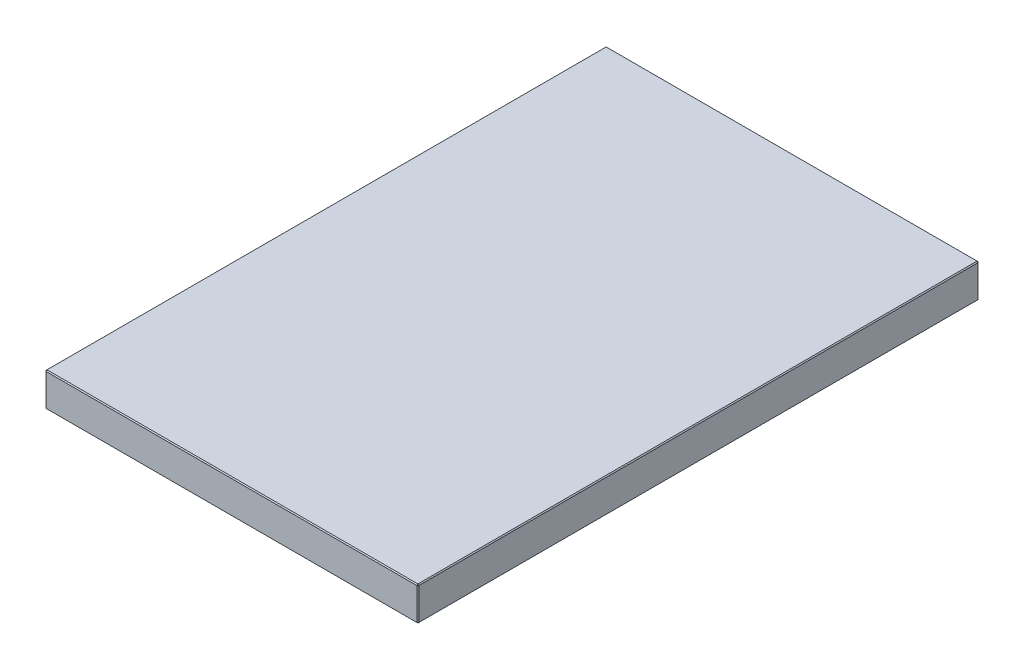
ISO-10303-21;
HEADER;
FILE_DESCRIPTION(('STEP AP214'),'2;1');
FILE_NAME('part.step','',(''),(''),'','','');
FILE_SCHEMA(('AUTOMOTIVE_DESIGN { 1 0 10303 214 1 1 1 1 }'));
ENDSEC;
DATA;
#1=APPLICATION_CONTEXT('core data for automotive mechanical design processes');
#2=APPLICATION_PROTOCOL_DEFINITION('international standard','automotive_design',2000,#1);
#3=PRODUCT_CONTEXT('',#1,'mechanical');
#4=PRODUCT('Part','Part','',(#3));
#5=PRODUCT_RELATED_PRODUCT_CATEGORY('part','',(#4));
#6=PRODUCT_DEFINITION_FORMATION('','',#4);
#7=PRODUCT_DEFINITION_CONTEXT('part definition',#1,'design');
#8=PRODUCT_DEFINITION('design','',#6,#7);
#9=PRODUCT_DEFINITION_SHAPE('','',#8);
#10=(LENGTH_UNIT() NAMED_UNIT(*) SI_UNIT(.MILLI.,.METRE.));
#11=(NAMED_UNIT(*) PLANE_ANGLE_UNIT() SI_UNIT($,.RADIAN.));
#12=(NAMED_UNIT(*) SI_UNIT($,.STERADIAN.) SOLID_ANGLE_UNIT());
#13=UNCERTAINTY_MEASURE_WITH_UNIT(LENGTH_MEASURE(1.E-05),#10,'distance_accuracy_value','');
#14=(GEOMETRIC_REPRESENTATION_CONTEXT(3) GLOBAL_UNCERTAINTY_ASSIGNED_CONTEXT((#13)) GLOBAL_UNIT_ASSIGNED_CONTEXT((#10,
#11,#12)) REPRESENTATION_CONTEXT('',''));
#15=CARTESIAN_POINT('',(0.,0.,0.));
#16=DIRECTION('',(0.,0.,1.));
#17=DIRECTION('',(1.,0.,0.));
#18=AXIS2_PLACEMENT_3D('',#15,#16,#17);
#19=CARTESIAN_POINT('',(198.,36.,298.));
#20=DIRECTION('',(-1.,0.,0.));
#21=DIRECTION('',(0.,0.,1.));
#22=AXIS2_PLACEMENT_3D('',#19,#20,#21);
#23=PLANE('',#22);
#24=DIRECTION('',(0.,0.,-1.));
#25=VECTOR('',#24,1.);
#26=CARTESIAN_POINT('',(198.,1.,-298.));
#27=LINE('',#26,#25);
#28=CARTESIAN_POINT('',(198.,1.,297.));
#29=VERTEX_POINT('',#28);
#30=CARTESIAN_POINT('',(198.,1.,-297.));
#31=VERTEX_POINT('',#30);
#32=EDGE_CURVE('E151',#29,#31,#27,.T.);
#33=ORIENTED_EDGE('',*,*,#32,.T.);
#34=DIRECTION('',(0.,1.,0.));
#35=VECTOR('',#34,1.);
#36=CARTESIAN_POINT('',(198.,36.,-297.));
#37=LINE('',#36,#35);
#38=CARTESIAN_POINT('',(198.,35.,-297.));
#39=VERTEX_POINT('',#38);
#40=EDGE_CURVE('E153',#31,#39,#37,.T.);
#41=ORIENTED_EDGE('',*,*,#40,.T.);
#42=DIRECTION('',(0.,0.,1.));
#43=VECTOR('',#42,1.);
#44=CARTESIAN_POINT('',(198.,35.,298.));
#45=LINE('',#44,#43);
#46=CARTESIAN_POINT('',(198.,35.,297.));
#47=VERTEX_POINT('',#46);
#48=EDGE_CURVE('E147',#39,#47,#45,.T.);
#49=ORIENTED_EDGE('',*,*,#48,.T.);
#50=DIRECTION('',(0.,-1.,0.));
#51=VECTOR('',#50,1.);
#52=CARTESIAN_POINT('',(198.,36.,297.));
#53=LINE('',#52,#51);
#54=EDGE_CURVE('E149',#47,#29,#53,.T.);
#55=ORIENTED_EDGE('',*,*,#54,.T.);
#56=EDGE_LOOP('',(#33,#41,#49,#55));
#57=FACE_BOUND('',#56,.T.);
#58=ADVANCED_FACE('F16',(#57),#23,.F.);
#59=CARTESIAN_POINT('',(-198.,36.,-298.));
#60=DIRECTION('',(0.,0.,1.));
#61=DIRECTION('',(1.,0.,0.));
#62=AXIS2_PLACEMENT_3D('',#59,#60,#61);
#63=PLANE('',#62);
#64=DIRECTION('',(0.,-1.,0.));
#65=VECTOR('',#64,1.);
#66=CARTESIAN_POINT('',(197.,36.,-298.));
#67=LINE('',#66,#65);
#68=CARTESIAN_POINT('',(197.,35.,-298.));
#69=VERTEX_POINT('',#68);
#70=CARTESIAN_POINT('',(197.,1.,-298.));
#71=VERTEX_POINT('',#70);
#72=EDGE_CURVE('E115',#69,#71,#67,.T.);
#73=ORIENTED_EDGE('',*,*,#72,.T.);
#74=DIRECTION('',(-1.,0.,0.));
#75=VECTOR('',#74,1.);
#76=CARTESIAN_POINT('',(-198.,1.,-298.));
#77=LINE('',#76,#75);
#78=CARTESIAN_POINT('',(-197.,1.,-298.));
#79=VERTEX_POINT('',#78);
#80=EDGE_CURVE('E111',#71,#79,#77,.T.);
#81=ORIENTED_EDGE('',*,*,#80,.T.);
#82=DIRECTION('',(0.,1.,0.));
#83=VECTOR('',#82,1.);
#84=CARTESIAN_POINT('',(-197.,36.,-298.));
#85=LINE('',#84,#83);
#86=CARTESIAN_POINT('',(-197.,35.,-298.));
#87=VERTEX_POINT('',#86);
#88=EDGE_CURVE('E103',#79,#87,#85,.T.);
#89=ORIENTED_EDGE('',*,*,#88,.T.);
#90=DIRECTION('',(1.,0.,0.));
#91=VECTOR('',#90,1.);
#92=CARTESIAN_POINT('',(-198.,35.,-298.));
#93=LINE('',#92,#91);
#94=EDGE_CURVE('E108',#87,#69,#93,.T.);
#95=ORIENTED_EDGE('',*,*,#94,.T.);
#96=EDGE_LOOP('',(#73,#81,#89,#95));
#97=FACE_BOUND('',#96,.T.);
#98=ADVANCED_FACE('F106',(#97),#63,.F.);
#99=CARTESIAN_POINT('',(-198.,36.,298.));
#100=DIRECTION('',(1.,0.,0.));
#101=DIRECTION('',(0.,0.,-1.));
#102=AXIS2_PLACEMENT_3D('',#99,#100,#101);
#103=PLANE('',#102);
#104=DIRECTION('',(0.,-1.,0.));
#105=VECTOR('',#104,1.);
#106=CARTESIAN_POINT('',(-198.,36.,-297.));
#107=LINE('',#106,#105);
#108=CARTESIAN_POINT('',(-198.,35.,-297.));
#109=VERTEX_POINT('',#108);
#110=CARTESIAN_POINT('',(-198.,1.,-297.));
#111=VERTEX_POINT('',#110);
#112=EDGE_CURVE('E123',#109,#111,#107,.T.);
#113=ORIENTED_EDGE('',*,*,#112,.T.);
#114=DIRECTION('',(0.,0.,1.));
#115=VECTOR('',#114,1.);
#116=CARTESIAN_POINT('',(-198.,1.,298.));
#117=LINE('',#116,#115);
#118=CARTESIAN_POINT('',(-198.,1.,297.));
#119=VERTEX_POINT('',#118);
#120=EDGE_CURVE('E161',#111,#119,#117,.T.);
#121=ORIENTED_EDGE('',*,*,#120,.T.);
#122=DIRECTION('',(0.,1.,0.));
#123=VECTOR('',#122,1.);
#124=CARTESIAN_POINT('',(-198.,36.,297.));
#125=LINE('',#124,#123);
#126=CARTESIAN_POINT('',(-198.,35.,297.));
#127=VERTEX_POINT('',#126);
#128=EDGE_CURVE('E158',#119,#127,#125,.T.);
#129=ORIENTED_EDGE('',*,*,#128,.T.);
#130=DIRECTION('',(0.,0.,-1.));
#131=VECTOR('',#130,1.);
#132=CARTESIAN_POINT('',(-198.,35.,298.));
#133=LINE('',#132,#131);
#134=EDGE_CURVE('E156',#127,#109,#133,.T.);
#135=ORIENTED_EDGE('',*,*,#134,.T.);
#136=EDGE_LOOP('',(#113,#121,#129,#135));
#137=FACE_BOUND('',#136,.T.);
#138=ADVANCED_FACE('F310',(#137),#103,.F.);
#139=CARTESIAN_POINT('',(-198.,36.,298.));
#140=DIRECTION('',(0.,0.,-1.));
#141=DIRECTION('',(-1.,0.,0.));
#142=AXIS2_PLACEMENT_3D('',#139,#140,#141);
#143=PLANE('',#142);
#144=DIRECTION('',(-1.,0.,0.));
#145=VECTOR('',#144,1.);
#146=CARTESIAN_POINT('',(-198.,35.,298.));
#147=LINE('',#146,#145);
#148=CARTESIAN_POINT('',(197.,35.,298.));
#149=VERTEX_POINT('',#148);
#150=CARTESIAN_POINT('',(-197.,35.,298.));
#151=VERTEX_POINT('',#150);
#152=EDGE_CURVE('E163',#149,#151,#147,.T.);
#153=ORIENTED_EDGE('',*,*,#152,.T.);
#154=DIRECTION('',(0.,-1.,0.));
#155=VECTOR('',#154,1.);
#156=CARTESIAN_POINT('',(-197.,36.,298.));
#157=LINE('',#156,#155);
#158=CARTESIAN_POINT('',(-197.,1.,298.));
#159=VERTEX_POINT('',#158);
#160=EDGE_CURVE('E169',#151,#159,#157,.T.);
#161=ORIENTED_EDGE('',*,*,#160,.T.);
#162=DIRECTION('',(1.,0.,0.));
#163=VECTOR('',#162,1.);
#164=CARTESIAN_POINT('',(198.,1.,298.));
#165=LINE('',#164,#163);
#166=CARTESIAN_POINT('',(197.,1.,298.));
#167=VERTEX_POINT('',#166);
#168=EDGE_CURVE('E167',#159,#167,#165,.T.);
#169=ORIENTED_EDGE('',*,*,#168,.T.);
#170=DIRECTION('',(0.,1.,0.));
#171=VECTOR('',#170,1.);
#172=CARTESIAN_POINT('',(197.,36.,298.));
#173=LINE('',#172,#171);
#174=EDGE_CURVE('E165',#167,#149,#173,.T.);
#175=ORIENTED_EDGE('',*,*,#174,.T.);
#176=EDGE_LOOP('',(#153,#161,#169,#175));
#177=FACE_BOUND('',#176,.T.);
#178=ADVANCED_FACE('F256',(#177),#143,.F.);
#179=CARTESIAN_POINT('',(0.,36.,0.));
#180=DIRECTION('',(0.,-1.,0.));
#181=DIRECTION('',(0.,0.,-1.));
#182=AXIS2_PLACEMENT_3D('',#179,#180,#181);
#183=PLANE('',#182);
#184=DIRECTION('',(0.,0.,1.));
#185=VECTOR('',#184,1.);
#186=CARTESIAN_POINT('',(-197.,36.,0.));
#187=LINE('',#186,#185);
#188=CARTESIAN_POINT('',(-197.,36.,-297.));
#189=VERTEX_POINT('',#188);
#190=CARTESIAN_POINT('',(-197.,36.,297.));
#191=VERTEX_POINT('',#190);
#192=EDGE_CURVE('E25',#189,#191,#187,.T.);
#193=ORIENTED_EDGE('',*,*,#192,.T.);
#194=DIRECTION('',(1.,0.,0.));
#195=VECTOR('',#194,1.);
#196=CARTESIAN_POINT('',(0.,36.,297.));
#197=LINE('',#196,#195);
#198=CARTESIAN_POINT('',(197.,36.,297.));
#199=VERTEX_POINT('',#198);
#200=EDGE_CURVE('E10',#191,#199,#197,.T.);
#201=ORIENTED_EDGE('',*,*,#200,.T.);
#202=DIRECTION('',(0.,0.,-1.));
#203=VECTOR('',#202,1.);
#204=CARTESIAN_POINT('',(197.,36.,0.));
#205=LINE('',#204,#203);
#206=CARTESIAN_POINT('',(197.,36.,-297.));
#207=VERTEX_POINT('',#206);
#208=EDGE_CURVE('E181',#199,#207,#205,.T.);
#209=ORIENTED_EDGE('',*,*,#208,.T.);
#210=DIRECTION('',(-1.,0.,0.));
#211=VECTOR('',#210,1.);
#212=CARTESIAN_POINT('',(0.,36.,-297.));
#213=LINE('',#212,#211);
#214=EDGE_CURVE('E36',#207,#189,#213,.T.);
#215=ORIENTED_EDGE('',*,*,#214,.T.);
#216=EDGE_LOOP('',(#193,#201,#209,#215));
#217=FACE_BOUND('',#216,.T.);
#218=ADVANCED_FACE('F271',(#217),#183,.F.);
#219=CARTESIAN_POINT('',(0.,0.,0.));
#220=DIRECTION('',(0.,-1.,0.));
#221=DIRECTION('',(0.,0.,-1.));
#222=AXIS2_PLACEMENT_3D('',#219,#220,#221);
#223=PLANE('',#222);
#224=DIRECTION('',(0.,0.,-1.));
#225=VECTOR('',#224,1.);
#226=CARTESIAN_POINT('',(-197.,0.,-298.));
#227=LINE('',#226,#225);
#228=CARTESIAN_POINT('',(-197.,0.,297.));
#229=VERTEX_POINT('',#228);
#230=CARTESIAN_POINT('',(-197.,0.,-297.));
#231=VERTEX_POINT('',#230);
#232=EDGE_CURVE('E176',#229,#231,#227,.T.);
#233=ORIENTED_EDGE('',*,*,#232,.T.);
#234=DIRECTION('',(1.,0.,0.));
#235=VECTOR('',#234,1.);
#236=CARTESIAN_POINT('',(198.,0.,-297.));
#237=LINE('',#236,#235);
#238=CARTESIAN_POINT('',(197.,0.,-297.));
#239=VERTEX_POINT('',#238);
#240=EDGE_CURVE('E178',#231,#239,#237,.T.);
#241=ORIENTED_EDGE('',*,*,#240,.T.);
#242=DIRECTION('',(0.,0.,1.));
#243=VECTOR('',#242,1.);
#244=CARTESIAN_POINT('',(197.,0.,298.));
#245=LINE('',#244,#243);
#246=CARTESIAN_POINT('',(197.,0.,297.));
#247=VERTEX_POINT('',#246);
#248=EDGE_CURVE('E172',#239,#247,#245,.T.);
#249=ORIENTED_EDGE('',*,*,#248,.T.);
#250=DIRECTION('',(-1.,0.,0.));
#251=VECTOR('',#250,1.);
#252=CARTESIAN_POINT('',(-198.,0.,297.));
#253=LINE('',#252,#251);
#254=EDGE_CURVE('E174',#247,#229,#253,.T.);
#255=ORIENTED_EDGE('',*,*,#254,.T.);
#256=EDGE_LOOP('',(#233,#241,#249,#255));
#257=FACE_BOUND('',#256,.T.);
#258=ADVANCED_FACE('F247',(#257),#223,.T.);
#259=CARTESIAN_POINT('',(-197.,36.,298.));
#260=DIRECTION('',(0.707106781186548,0.,-0.707106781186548));
#261=DIRECTION('',(0.,-1.,0.));
#262=AXIS2_PLACEMENT_3D('',#259,#260,#261);
#263=PLANE('',#262);
#264=DIRECTION('',(-0.707106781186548,0.,-0.707106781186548));
#265=VECTOR('',#264,1.);
#266=CARTESIAN_POINT('',(-198.,35.,297.));
#267=LINE('',#266,#265);
#268=EDGE_CURVE('E20',#127,#151,#267,.F.);
#269=ORIENTED_EDGE('',*,*,#268,.F.);
#270=ORIENTED_EDGE('',*,*,#128,.F.);
#271=DIRECTION('',(0.707106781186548,0.,0.707106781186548));
#272=VECTOR('',#271,1.);
#273=CARTESIAN_POINT('',(-197.,1.,298.));
#274=LINE('',#273,#272);
#275=EDGE_CURVE('E143',#159,#119,#274,.F.);
#276=ORIENTED_EDGE('',*,*,#275,.F.);
#277=ORIENTED_EDGE('',*,*,#160,.F.);
#278=EDGE_LOOP('',(#269,#270,#276,#277));
#279=FACE_BOUND('',#278,.T.);
#280=ADVANCED_FACE('F18',(#279),#263,.F.);
#281=CARTESIAN_POINT('',(-198.,35.,297.));
#282=DIRECTION('',(-0.577350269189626,0.577350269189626,0.577350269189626));
#283=DIRECTION('',(0.707106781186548,0.,0.707106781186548));
#284=AXIS2_PLACEMENT_3D('',#281,#282,#283);
#285=PLANE('',#284);
#286=DIRECTION('',(0.707106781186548,0.707106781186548,0.));
#287=VECTOR('',#286,1.);
#288=CARTESIAN_POINT('',(-198.,35.,297.));
#289=LINE('',#288,#287);
#290=EDGE_CURVE('E227',#127,#191,#289,.T.);
#291=ORIENTED_EDGE('',*,*,#290,.F.);
#292=ORIENTED_EDGE('',*,*,#268,.T.);
#293=DIRECTION('',(0.,-0.707106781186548,0.707106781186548));
#294=VECTOR('',#293,1.);
#295=CARTESIAN_POINT('',(-197.,35.5,297.5));
#296=LINE('',#295,#294);
#297=EDGE_CURVE('E229',#191,#151,#296,.T.);
#298=ORIENTED_EDGE('',*,*,#297,.F.);
#299=EDGE_LOOP('',(#291,#292,#298));
#300=FACE_BOUND('',#299,.T.);
#301=ADVANCED_FACE('F460',(#300),#285,.T.);
#302=CARTESIAN_POINT('',(-197.,1.,298.));
#303=DIRECTION('',(-0.577350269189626,-0.577350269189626,0.577350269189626));
#304=DIRECTION('',(0.707106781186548,0.,0.707106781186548));
#305=AXIS2_PLACEMENT_3D('',#302,#303,#304);
#306=PLANE('',#305);
#307=DIRECTION('',(0.,0.707106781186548,0.707106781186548));
#308=VECTOR('',#307,1.);
#309=CARTESIAN_POINT('',(-197.,1.,298.));
#310=LINE('',#309,#308);
#311=EDGE_CURVE('E221',#159,#229,#310,.F.);
#312=ORIENTED_EDGE('',*,*,#311,.F.);
#313=ORIENTED_EDGE('',*,*,#275,.T.);
#314=DIRECTION('',(0.707106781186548,-0.707106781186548,0.));
#315=VECTOR('',#314,1.);
#316=CARTESIAN_POINT('',(-197.5,0.5,297.));
#317=LINE('',#316,#315);
#318=EDGE_CURVE('E224',#229,#119,#317,.F.);
#319=ORIENTED_EDGE('',*,*,#318,.F.);
#320=EDGE_LOOP('',(#312,#313,#319));
#321=FACE_BOUND('',#320,.T.);
#322=ADVANCED_FACE('F236',(#321),#306,.T.);
#323=CARTESIAN_POINT('',(0.,36.,297.));
#324=DIRECTION('',(0.,-0.707106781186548,-0.707106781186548));
#325=DIRECTION('',(1.,0.,0.));
#326=AXIS2_PLACEMENT_3D('',#323,#324,#325);
#327=PLANE('',#326);
#328=ORIENTED_EDGE('',*,*,#297,.T.);
#329=ORIENTED_EDGE('',*,*,#152,.F.);
#330=DIRECTION('',(0.,0.707106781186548,-0.707106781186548));
#331=VECTOR('',#330,1.);
#332=CARTESIAN_POINT('',(197.,35.,298.));
#333=LINE('',#332,#331);
#334=EDGE_CURVE('E215',#199,#149,#333,.F.);
#335=ORIENTED_EDGE('',*,*,#334,.F.);
#336=ORIENTED_EDGE('',*,*,#200,.F.);
#337=EDGE_LOOP('',(#328,#329,#335,#336));
#338=FACE_BOUND('',#337,.T.);
#339=ADVANCED_FACE('F270',(#338),#327,.F.);
#340=CARTESIAN_POINT('',(-197.,36.,0.));
#341=DIRECTION('',(0.707106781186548,-0.707106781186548,0.));
#342=DIRECTION('',(0.,0.,1.));
#343=AXIS2_PLACEMENT_3D('',#340,#341,#342);
#344=PLANE('',#343);
#345=ORIENTED_EDGE('',*,*,#290,.T.);
#346=ORIENTED_EDGE('',*,*,#192,.F.);
#347=DIRECTION('',(-0.707106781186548,-0.707106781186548,0.));
#348=VECTOR('',#347,1.);
#349=CARTESIAN_POINT('',(-197.5,35.5,-297.));
#350=LINE('',#349,#348);
#351=EDGE_CURVE('E127',#109,#189,#350,.F.);
#352=ORIENTED_EDGE('',*,*,#351,.F.);
#353=ORIENTED_EDGE('',*,*,#134,.F.);
#354=EDGE_LOOP('',(#345,#346,#352,#353));
#355=FACE_BOUND('',#354,.T.);
#356=ADVANCED_FACE('F437',(#355),#344,.F.);
#357=CARTESIAN_POINT('',(-198.,36.,-297.));
#358=DIRECTION('',(0.707106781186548,0.,0.707106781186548));
#359=DIRECTION('',(0.,-1.,0.));
#360=AXIS2_PLACEMENT_3D('',#357,#358,#359);
#361=PLANE('',#360);
#362=DIRECTION('',(-0.707106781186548,0.,0.707106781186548));
#363=VECTOR('',#362,1.);
#364=CARTESIAN_POINT('',(-198.,1.,-297.));
#365=LINE('',#364,#363);
#366=EDGE_CURVE('E128',#111,#79,#365,.F.);
#367=ORIENTED_EDGE('',*,*,#366,.F.);
#368=ORIENTED_EDGE('',*,*,#112,.F.);
#369=DIRECTION('',(0.707106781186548,0.,-0.707106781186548));
#370=VECTOR('',#369,1.);
#371=CARTESIAN_POINT('',(-197.,35.,-298.));
#372=LINE('',#371,#370);
#373=EDGE_CURVE('E119',#87,#109,#372,.F.);
#374=ORIENTED_EDGE('',*,*,#373,.F.);
#375=ORIENTED_EDGE('',*,*,#88,.F.);
#376=EDGE_LOOP('',(#367,#368,#374,#375));
#377=FACE_BOUND('',#376,.T.);
#378=ADVANCED_FACE('F121',(#377),#361,.F.);
#379=CARTESIAN_POINT('',(-198.,1.,298.));
#380=DIRECTION('',(-0.707106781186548,-0.707106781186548,0.));
#381=DIRECTION('',(0.,0.,-1.));
#382=AXIS2_PLACEMENT_3D('',#379,#380,#381);
#383=PLANE('',#382);
#384=ORIENTED_EDGE('',*,*,#318,.T.);
#385=ORIENTED_EDGE('',*,*,#120,.F.);
#386=DIRECTION('',(-0.707106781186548,0.707106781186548,0.));
#387=VECTOR('',#386,1.);
#388=CARTESIAN_POINT('',(-198.,1.,-297.));
#389=LINE('',#388,#387);
#390=EDGE_CURVE('E211',#231,#111,#389,.T.);
#391=ORIENTED_EDGE('',*,*,#390,.F.);
#392=ORIENTED_EDGE('',*,*,#232,.F.);
#393=EDGE_LOOP('',(#384,#385,#391,#392));
#394=FACE_BOUND('',#393,.T.);
#395=ADVANCED_FACE('F243',(#394),#383,.T.);
#396=CARTESIAN_POINT('',(-198.,1.,298.));
#397=DIRECTION('',(0.,-0.707106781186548,0.707106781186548));
#398=DIRECTION('',(-1.,0.,0.));
#399=AXIS2_PLACEMENT_3D('',#396,#397,#398);
#400=PLANE('',#399);
#401=ORIENTED_EDGE('',*,*,#311,.T.);
#402=ORIENTED_EDGE('',*,*,#254,.F.);
#403=DIRECTION('',(0.,-0.707106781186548,-0.707106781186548));
#404=VECTOR('',#403,1.);
#405=CARTESIAN_POINT('',(197.,1.,298.));
#406=LINE('',#405,#404);
#407=EDGE_CURVE('E208',#167,#247,#406,.T.);
#408=ORIENTED_EDGE('',*,*,#407,.F.);
#409=ORIENTED_EDGE('',*,*,#168,.F.);
#410=EDGE_LOOP('',(#401,#402,#408,#409));
#411=FACE_BOUND('',#410,.T.);
#412=ADVANCED_FACE('F253',(#411),#400,.T.);
#413=CARTESIAN_POINT('',(198.,36.,297.));
#414=DIRECTION('',(-0.707106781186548,0.,-0.707106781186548));
#415=DIRECTION('',(0.,-1.,0.));
#416=AXIS2_PLACEMENT_3D('',#413,#414,#415);
#417=PLANE('',#416);
#418=DIRECTION('',(-0.707106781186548,0.,0.707106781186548));
#419=VECTOR('',#418,1.);
#420=CARTESIAN_POINT('',(197.,35.,298.));
#421=LINE('',#420,#419);
#422=EDGE_CURVE('E218',#149,#47,#421,.F.);
#423=ORIENTED_EDGE('',*,*,#422,.F.);
#424=ORIENTED_EDGE('',*,*,#174,.F.);
#425=DIRECTION('',(0.707106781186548,0.,-0.707106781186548));
#426=VECTOR('',#425,1.);
#427=CARTESIAN_POINT('',(197.,1.,298.));
#428=LINE('',#427,#426);
#429=EDGE_CURVE('E205',#29,#167,#428,.F.);
#430=ORIENTED_EDGE('',*,*,#429,.F.);
#431=ORIENTED_EDGE('',*,*,#54,.F.);
#432=EDGE_LOOP('',(#423,#424,#430,#431));
#433=FACE_BOUND('',#432,.T.);
#434=ADVANCED_FACE('F261',(#433),#417,.F.);
#435=CARTESIAN_POINT('',(197.,35.,298.));
#436=DIRECTION('',(0.577350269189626,0.577350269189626,0.577350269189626));
#437=DIRECTION('',(0.707106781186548,0.,-0.707106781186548));
#438=AXIS2_PLACEMENT_3D('',#435,#436,#437);
#439=PLANE('',#438);
#440=ORIENTED_EDGE('',*,*,#334,.T.);
#441=ORIENTED_EDGE('',*,*,#422,.T.);
#442=DIRECTION('',(0.707106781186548,-0.707106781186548,0.));
#443=VECTOR('',#442,1.);
#444=CARTESIAN_POINT('',(197.5,35.5,297.));
#445=LINE('',#444,#443);
#446=EDGE_CURVE('E134',#199,#47,#445,.T.);
#447=ORIENTED_EDGE('',*,*,#446,.F.);
#448=EDGE_LOOP('',(#440,#441,#447));
#449=FACE_BOUND('',#448,.T.);
#450=ADVANCED_FACE('F267',(#449),#439,.T.);
#451=CARTESIAN_POINT('',(-197.,35.,-298.));
#452=DIRECTION('',(-0.577350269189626,0.577350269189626,-0.577350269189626));
#453=DIRECTION('',(-0.707106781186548,0.,0.707106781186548));
#454=AXIS2_PLACEMENT_3D('',#451,#452,#453);
#455=PLANE('',#454);
#456=ORIENTED_EDGE('',*,*,#373,.T.);
#457=ORIENTED_EDGE('',*,*,#351,.T.);
#458=DIRECTION('',(0.,0.707106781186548,0.707106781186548));
#459=VECTOR('',#458,1.);
#460=CARTESIAN_POINT('',(-197.,35.,-298.));
#461=LINE('',#460,#459);
#462=EDGE_CURVE('E131',#87,#189,#461,.T.);
#463=ORIENTED_EDGE('',*,*,#462,.F.);
#464=EDGE_LOOP('',(#456,#457,#463));
#465=FACE_BOUND('',#464,.T.);
#466=ADVANCED_FACE('F132',(#465),#455,.T.);
#467=CARTESIAN_POINT('',(-198.,1.,-297.));
#468=DIRECTION('',(-0.577350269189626,-0.577350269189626,-0.577350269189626));
#469=DIRECTION('',(-0.707106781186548,0.,0.707106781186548));
#470=AXIS2_PLACEMENT_3D('',#467,#468,#469);
#471=PLANE('',#470);
#472=ORIENTED_EDGE('',*,*,#390,.T.);
#473=ORIENTED_EDGE('',*,*,#366,.T.);
#474=DIRECTION('',(0.,-0.707106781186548,0.707106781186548));
#475=VECTOR('',#474,1.);
#476=CARTESIAN_POINT('',(-197.,0.5,-297.5));
#477=LINE('',#476,#475);
#478=EDGE_CURVE('E135',#231,#79,#477,.F.);
#479=ORIENTED_EDGE('',*,*,#478,.F.);
#480=EDGE_LOOP('',(#472,#473,#479));
#481=FACE_BOUND('',#480,.T.);
#482=ADVANCED_FACE('F290',(#481),#471,.T.);
#483=CARTESIAN_POINT('',(197.,1.,298.));
#484=DIRECTION('',(0.577350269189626,-0.577350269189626,0.577350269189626));
#485=DIRECTION('',(0.707106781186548,0.,-0.707106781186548));
#486=AXIS2_PLACEMENT_3D('',#483,#484,#485);
#487=PLANE('',#486);
#488=ORIENTED_EDGE('',*,*,#429,.T.);
#489=ORIENTED_EDGE('',*,*,#407,.T.);
#490=DIRECTION('',(0.707106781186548,0.707106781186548,0.));
#491=VECTOR('',#490,1.);
#492=CARTESIAN_POINT('',(197.5,0.5,297.));
#493=LINE('',#492,#491);
#494=EDGE_CURVE('E198',#29,#247,#493,.F.);
#495=ORIENTED_EDGE('',*,*,#494,.F.);
#496=EDGE_LOOP('',(#488,#489,#495));
#497=FACE_BOUND('',#496,.T.);
#498=ADVANCED_FACE('F292',(#497),#487,.T.);
#499=CARTESIAN_POINT('',(197.,36.,0.));
#500=DIRECTION('',(-0.707106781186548,-0.707106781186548,0.));
#501=DIRECTION('',(0.,0.,-1.));
#502=AXIS2_PLACEMENT_3D('',#499,#500,#501);
#503=PLANE('',#502);
#504=ORIENTED_EDGE('',*,*,#446,.T.);
#505=ORIENTED_EDGE('',*,*,#48,.F.);
#506=DIRECTION('',(-0.707106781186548,0.707106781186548,0.));
#507=VECTOR('',#506,1.);
#508=CARTESIAN_POINT('',(198.,35.,-297.));
#509=LINE('',#508,#507);
#510=EDGE_CURVE('E195',#207,#39,#509,.F.);
#511=ORIENTED_EDGE('',*,*,#510,.F.);
#512=ORIENTED_EDGE('',*,*,#208,.F.);
#513=EDGE_LOOP('',(#504,#505,#511,#512));
#514=FACE_BOUND('',#513,.T.);
#515=ADVANCED_FACE('F275',(#514),#503,.F.);
#516=CARTESIAN_POINT('',(0.,36.,-297.));
#517=DIRECTION('',(0.,-0.707106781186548,0.707106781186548));
#518=DIRECTION('',(-1.,0.,0.));
#519=AXIS2_PLACEMENT_3D('',#516,#517,#518);
#520=PLANE('',#519);
#521=ORIENTED_EDGE('',*,*,#462,.T.);
#522=ORIENTED_EDGE('',*,*,#214,.F.);
#523=DIRECTION('',(0.,-0.707106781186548,-0.707106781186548));
#524=VECTOR('',#523,1.);
#525=CARTESIAN_POINT('',(197.,35.5,-297.5));
#526=LINE('',#525,#524);
#527=EDGE_CURVE('E139',#69,#207,#526,.F.);
#528=ORIENTED_EDGE('',*,*,#527,.F.);
#529=ORIENTED_EDGE('',*,*,#94,.F.);
#530=EDGE_LOOP('',(#521,#522,#528,#529));
#531=FACE_BOUND('',#530,.T.);
#532=ADVANCED_FACE('F137',(#531),#520,.F.);
#533=CARTESIAN_POINT('',(-198.,1.,-298.));
#534=DIRECTION('',(0.,-0.707106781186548,-0.707106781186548));
#535=DIRECTION('',(1.,0.,0.));
#536=AXIS2_PLACEMENT_3D('',#533,#534,#535);
#537=PLANE('',#536);
#538=ORIENTED_EDGE('',*,*,#478,.T.);
#539=ORIENTED_EDGE('',*,*,#80,.F.);
#540=DIRECTION('',(0.,0.707106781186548,-0.707106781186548));
#541=VECTOR('',#540,1.);
#542=CARTESIAN_POINT('',(197.,1.,-298.));
#543=LINE('',#542,#541);
#544=EDGE_CURVE('E191',#239,#71,#543,.T.);
#545=ORIENTED_EDGE('',*,*,#544,.F.);
#546=ORIENTED_EDGE('',*,*,#240,.F.);
#547=EDGE_LOOP('',(#538,#539,#545,#546));
#548=FACE_BOUND('',#547,.T.);
#549=ADVANCED_FACE('F288',(#548),#537,.T.);
#550=CARTESIAN_POINT('',(198.,1.,298.));
#551=DIRECTION('',(0.707106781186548,-0.707106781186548,0.));
#552=DIRECTION('',(0.,0.,1.));
#553=AXIS2_PLACEMENT_3D('',#550,#551,#552);
#554=PLANE('',#553);
#555=ORIENTED_EDGE('',*,*,#494,.T.);
#556=ORIENTED_EDGE('',*,*,#248,.F.);
#557=DIRECTION('',(-0.707106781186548,-0.707106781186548,0.));
#558=VECTOR('',#557,1.);
#559=CARTESIAN_POINT('',(197.5,0.5,-297.));
#560=LINE('',#559,#558);
#561=EDGE_CURVE('E189',#31,#239,#560,.T.);
#562=ORIENTED_EDGE('',*,*,#561,.F.);
#563=ORIENTED_EDGE('',*,*,#32,.F.);
#564=EDGE_LOOP('',(#555,#556,#562,#563));
#565=FACE_BOUND('',#564,.T.);
#566=ADVANCED_FACE('F320',(#565),#554,.T.);
#567=CARTESIAN_POINT('',(198.,35.,-297.));
#568=DIRECTION('',(0.577350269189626,0.577350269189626,-0.577350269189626));
#569=DIRECTION('',(-0.707106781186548,0.,-0.707106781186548));
#570=AXIS2_PLACEMENT_3D('',#567,#568,#569);
#571=PLANE('',#570);
#572=ORIENTED_EDGE('',*,*,#527,.T.);
#573=ORIENTED_EDGE('',*,*,#510,.T.);
#574=DIRECTION('',(0.707106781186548,0.,0.707106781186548));
#575=VECTOR('',#574,1.);
#576=CARTESIAN_POINT('',(198.,35.,-297.));
#577=LINE('',#576,#575);
#578=EDGE_CURVE('E187',#69,#39,#577,.T.);
#579=ORIENTED_EDGE('',*,*,#578,.F.);
#580=EDGE_LOOP('',(#572,#573,#579));
#581=FACE_BOUND('',#580,.T.);
#582=ADVANCED_FACE('F277',(#581),#571,.T.);
#583=CARTESIAN_POINT('',(197.,1.,-298.));
#584=DIRECTION('',(0.577350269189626,-0.577350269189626,-0.577350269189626));
#585=DIRECTION('',(-0.707106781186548,0.,-0.707106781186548));
#586=AXIS2_PLACEMENT_3D('',#583,#584,#585);
#587=PLANE('',#586);
#588=ORIENTED_EDGE('',*,*,#561,.T.);
#589=ORIENTED_EDGE('',*,*,#544,.T.);
#590=DIRECTION('',(-0.707106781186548,0.,-0.707106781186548));
#591=VECTOR('',#590,1.);
#592=CARTESIAN_POINT('',(197.,1.,-298.));
#593=LINE('',#592,#591);
#594=EDGE_CURVE('E185',#31,#71,#593,.T.);
#595=ORIENTED_EDGE('',*,*,#594,.F.);
#596=EDGE_LOOP('',(#588,#589,#595));
#597=FACE_BOUND('',#596,.T.);
#598=ADVANCED_FACE('F285',(#597),#587,.T.);
#599=CARTESIAN_POINT('',(197.,36.,-298.));
#600=DIRECTION('',(-0.707106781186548,0.,0.707106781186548));
#601=DIRECTION('',(0.,-1.,0.));
#602=AXIS2_PLACEMENT_3D('',#599,#600,#601);
#603=PLANE('',#602);
#604=ORIENTED_EDGE('',*,*,#578,.T.);
#605=ORIENTED_EDGE('',*,*,#40,.F.);
#606=ORIENTED_EDGE('',*,*,#594,.T.);
#607=ORIENTED_EDGE('',*,*,#72,.F.);
#608=EDGE_LOOP('',(#604,#605,#606,#607));
#609=FACE_BOUND('',#608,.T.);
#610=ADVANCED_FACE('F281',(#609),#603,.F.);
#611=CLOSED_SHELL('',(#58,#98,#138,#178,#218,#258,#280,#301,#322,#339,#356,#378,#395,#412,#434,
#450,#466,#482,#498,#515,#532,#549,#566,#582,#598,#610));
#612=MANIFOLD_SOLID_BREP('B1',#611);
#613=ADVANCED_BREP_SHAPE_REPRESENTATION('',(#18,#612),#14);
#614=SHAPE_DEFINITION_REPRESENTATION(#9,#613);
ENDSEC;
END-ISO-10303-21;
